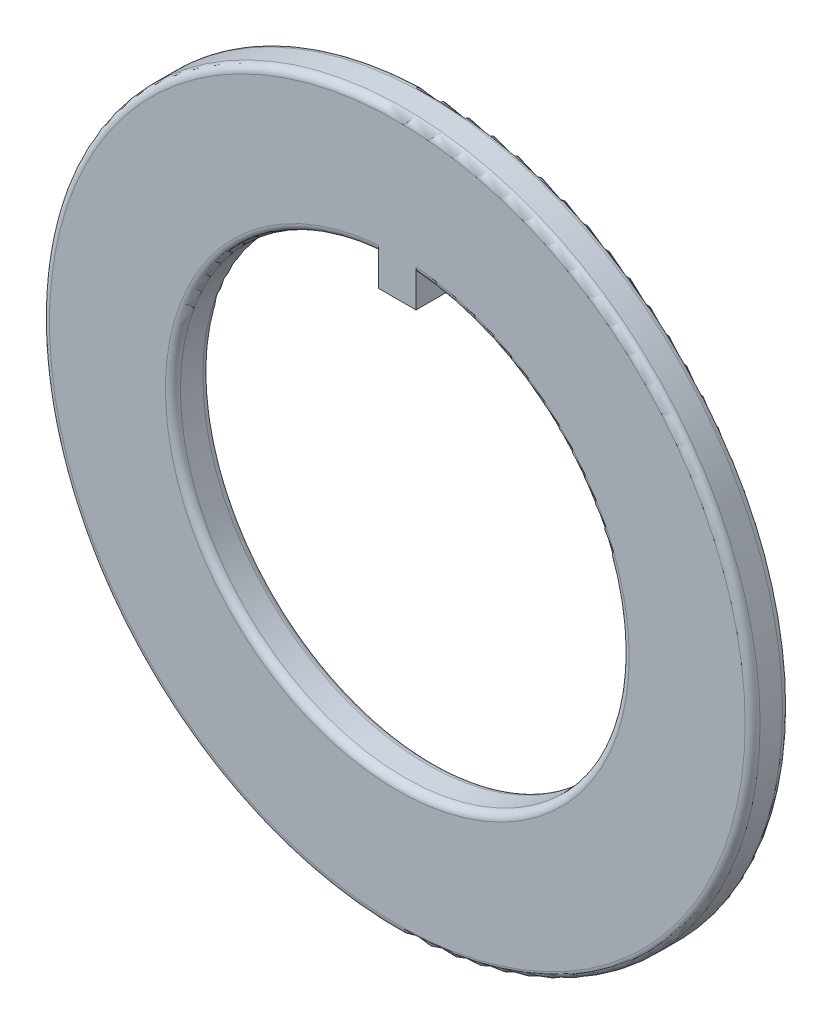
ISO-10303-21;
HEADER;
FILE_DESCRIPTION(('STEP AP214'),'2;1');
FILE_NAME('part.step','',(''),(''),'','','');
FILE_SCHEMA(('AUTOMOTIVE_DESIGN { 1 0 10303 214 1 1 1 1 }'));
ENDSEC;
DATA;
#1=APPLICATION_CONTEXT('core data for automotive mechanical design processes');
#2=APPLICATION_PROTOCOL_DEFINITION('international standard','automotive_design',2000,#1);
#3=PRODUCT_CONTEXT('',#1,'mechanical');
#4=PRODUCT('Part','Part','',(#3));
#5=PRODUCT_RELATED_PRODUCT_CATEGORY('part','',(#4));
#6=PRODUCT_DEFINITION_FORMATION('','',#4);
#7=PRODUCT_DEFINITION_CONTEXT('part definition',#1,'design');
#8=PRODUCT_DEFINITION('design','',#6,#7);
#9=PRODUCT_DEFINITION_SHAPE('','',#8);
#10=(LENGTH_UNIT() NAMED_UNIT(*) SI_UNIT(.MILLI.,.METRE.));
#11=(NAMED_UNIT(*) PLANE_ANGLE_UNIT() SI_UNIT($,.RADIAN.));
#12=(NAMED_UNIT(*) SI_UNIT($,.STERADIAN.) SOLID_ANGLE_UNIT());
#13=UNCERTAINTY_MEASURE_WITH_UNIT(LENGTH_MEASURE(1.E-05),#10,'distance_accuracy_value','');
#14=(GEOMETRIC_REPRESENTATION_CONTEXT(3) GLOBAL_UNCERTAINTY_ASSIGNED_CONTEXT((#13)) GLOBAL_UNIT_ASSIGNED_CONTEXT((#10,
#11,#12)) REPRESENTATION_CONTEXT('',''));
#15=CARTESIAN_POINT('',(0.,0.,0.));
#16=DIRECTION('',(0.,0.,1.));
#17=DIRECTION('',(1.,0.,0.));
#18=AXIS2_PLACEMENT_3D('',#15,#16,#17);
#19=CARTESIAN_POINT('',(0.,0.,1.));
#20=DIRECTION('',(0.,0.,1.));
#21=DIRECTION('',(1.,0.,0.));
#22=AXIS2_PLACEMENT_3D('',#19,#20,#21);
#23=PLANE('',#22);
#24=CARTESIAN_POINT('',(0.,0.,1.));
#25=DIRECTION('',(0.,0.,1.));
#26=DIRECTION('',(1.,0.,0.));
#27=AXIS2_PLACEMENT_3D('',#24,#25,#26);
#28=CIRCLE('',#27,9.3);
#29=CARTESIAN_POINT('',(9.3,0.,1.));
#30=VERTEX_POINT('',#29);
#31=EDGE_CURVE('E135',#30,#30,#28,.T.);
#32=ORIENTED_EDGE('',*,*,#31,.T.);
#33=EDGE_LOOP('',(#32));
#34=FACE_BOUND('',#33,.T.);
#35=DIRECTION('',(0.,-1.,0.));
#36=VECTOR('',#35,1.);
#37=CARTESIAN_POINT('',(0.5,5.1791303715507,1.));
#38=LINE('',#37,#36);
#39=CARTESIAN_POINT('',(0.5,6.17980582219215,1.));
#40=VERTEX_POINT('',#39);
#41=CARTESIAN_POINT('',(0.5,5.1791303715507,1.));
#42=VERTEX_POINT('',#41);
#43=EDGE_CURVE('E52',#40,#42,#38,.T.);
#44=ORIENTED_EDGE('',*,*,#43,.F.);
#45=CARTESIAN_POINT('',(0.,0.,1.));
#46=DIRECTION('',(0.,0.,1.));
#47=DIRECTION('',(1.,0.,0.));
#48=AXIS2_PLACEMENT_3D('',#45,#46,#47);
#49=CIRCLE('',#48,6.2);
#50=CARTESIAN_POINT('',(-0.5,6.17980582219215,1.));
#51=VERTEX_POINT('',#50);
#52=EDGE_CURVE('E138',#40,#51,#49,.F.);
#53=ORIENTED_EDGE('',*,*,#52,.T.);
#54=DIRECTION('',(0.,1.,0.));
#55=VECTOR('',#54,1.);
#56=CARTESIAN_POINT('',(-0.5,5.9791303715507,1.));
#57=LINE('',#56,#55);
#58=CARTESIAN_POINT('',(-0.5,5.1791303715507,1.));
#59=VERTEX_POINT('',#58);
#60=EDGE_CURVE('E59',#59,#51,#57,.T.);
#61=ORIENTED_EDGE('',*,*,#60,.F.);
#62=DIRECTION('',(-1.,0.,0.));
#63=VECTOR('',#62,1.);
#64=CARTESIAN_POINT('',(-0.5,5.1791303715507,1.));
#65=LINE('',#64,#63);
#66=EDGE_CURVE('E93',#42,#59,#65,.T.);
#67=ORIENTED_EDGE('',*,*,#66,.F.);
#68=EDGE_LOOP('',(#44,#53,#61,#67));
#69=FACE_BOUND('',#68,.T.);
#70=ADVANCED_FACE('F33',(#34,#69),#23,.T.);
#71=CARTESIAN_POINT('',(0.,0.,0.));
#72=DIRECTION('',(0.,0.,1.));
#73=DIRECTION('',(1.,0.,0.));
#74=AXIS2_PLACEMENT_3D('',#71,#72,#73);
#75=PLANE('',#74);
#76=CARTESIAN_POINT('',(0.,0.,0.));
#77=DIRECTION('',(0.,0.,1.));
#78=DIRECTION('',(1.,0.,0.));
#79=AXIS2_PLACEMENT_3D('',#76,#77,#78);
#80=CIRCLE('',#79,9.3);
#81=CARTESIAN_POINT('',(9.3,0.,0.));
#82=VERTEX_POINT('',#81);
#83=EDGE_CURVE('E118',#82,#82,#80,.F.);
#84=ORIENTED_EDGE('',*,*,#83,.T.);
#85=EDGE_LOOP('',(#84));
#86=FACE_BOUND('',#85,.T.);
#87=CARTESIAN_POINT('',(0.,0.,0.));
#88=DIRECTION('',(0.,0.,1.));
#89=DIRECTION('',(1.,0.,0.));
#90=AXIS2_PLACEMENT_3D('',#87,#88,#89);
#91=CIRCLE('',#90,6.2);
#92=CARTESIAN_POINT('',(-0.5,6.17980582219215,0.));
#93=VERTEX_POINT('',#92);
#94=CARTESIAN_POINT('',(0.5,6.17980582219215,0.));
#95=VERTEX_POINT('',#94);
#96=EDGE_CURVE('E121',#93,#95,#91,.T.);
#97=ORIENTED_EDGE('',*,*,#96,.T.);
#98=DIRECTION('',(0.,-1.,0.));
#99=VECTOR('',#98,1.);
#100=CARTESIAN_POINT('',(0.5,5.1791303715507,0.));
#101=LINE('',#100,#99);
#102=CARTESIAN_POINT('',(0.5,5.1791303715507,0.));
#103=VERTEX_POINT('',#102);
#104=EDGE_CURVE('E109',#95,#103,#101,.T.);
#105=ORIENTED_EDGE('',*,*,#104,.T.);
#106=DIRECTION('',(-1.,0.,0.));
#107=VECTOR('',#106,1.);
#108=CARTESIAN_POINT('',(-0.5,5.1791303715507,0.));
#109=LINE('',#108,#107);
#110=CARTESIAN_POINT('',(-0.5,5.1791303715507,0.));
#111=VERTEX_POINT('',#110);
#112=EDGE_CURVE('E100',#103,#111,#109,.T.);
#113=ORIENTED_EDGE('',*,*,#112,.T.);
#114=DIRECTION('',(0.,1.,0.));
#115=VECTOR('',#114,1.);
#116=CARTESIAN_POINT('',(-0.5,5.9791303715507,0.));
#117=LINE('',#116,#115);
#118=EDGE_CURVE('E94',#111,#93,#117,.T.);
#119=ORIENTED_EDGE('',*,*,#118,.T.);
#120=EDGE_LOOP('',(#97,#105,#113,#119));
#121=FACE_BOUND('',#120,.T.);
#122=ADVANCED_FACE('F181',(#86,#121),#75,.F.);
#123=CARTESIAN_POINT('',(0.,0.,1.));
#124=DIRECTION('',(0.,0.,-1.));
#125=DIRECTION('',(-1.,0.,0.));
#126=AXIS2_PLACEMENT_3D('',#123,#124,#125);
#127=CYLINDRICAL_SURFACE('',#126,9.5);
#128=CARTESIAN_POINT('',(0.,0.,0.2));
#129=DIRECTION('',(0.,0.,1.));
#130=DIRECTION('',(1.,0.,0.));
#131=AXIS2_PLACEMENT_3D('',#128,#129,#130);
#132=CIRCLE('',#131,9.5);
#133=CARTESIAN_POINT('',(9.5,0.,0.2));
#134=VERTEX_POINT('',#133);
#135=EDGE_CURVE('E132',#134,#134,#132,.T.);
#136=ORIENTED_EDGE('',*,*,#135,.T.);
#137=EDGE_LOOP('',(#136));
#138=FACE_BOUND('',#137,.T.);
#139=CARTESIAN_POINT('',(0.,0.,0.8));
#140=DIRECTION('',(0.,0.,1.));
#141=DIRECTION('',(1.,0.,0.));
#142=AXIS2_PLACEMENT_3D('',#139,#140,#141);
#143=CIRCLE('',#142,9.5);
#144=CARTESIAN_POINT('',(9.5,0.,0.8));
#145=VERTEX_POINT('',#144);
#146=EDGE_CURVE('E129',#145,#145,#143,.F.);
#147=ORIENTED_EDGE('',*,*,#146,.T.);
#148=EDGE_LOOP('',(#147));
#149=FACE_BOUND('',#148,.T.);
#150=ADVANCED_FACE('F186',(#138,#149),#127,.T.);
#151=CARTESIAN_POINT('',(0.,0.,1.));
#152=DIRECTION('',(0.,0.,-1.));
#153=DIRECTION('',(-1.,0.,0.));
#154=AXIS2_PLACEMENT_3D('',#151,#152,#153);
#155=CYLINDRICAL_SURFACE('',#154,6.);
#156=DIRECTION('',(0.,0.,-1.));
#157=VECTOR('',#156,1.);
#158=CARTESIAN_POINT('',(0.5,5.9791303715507,1.));
#159=LINE('',#158,#157);
#160=CARTESIAN_POINT('',(0.5,5.9791303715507,0.8));
#161=VERTEX_POINT('',#160);
#162=CARTESIAN_POINT('',(0.5,5.9791303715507,0.2));
#163=VERTEX_POINT('',#162);
#164=EDGE_CURVE('E102',#161,#163,#159,.T.);
#165=ORIENTED_EDGE('',*,*,#164,.T.);
#166=CARTESIAN_POINT('',(0.,0.,0.2));
#167=DIRECTION('',(0.,0.,1.));
#168=DIRECTION('',(1.,0.,0.));
#169=AXIS2_PLACEMENT_3D('',#166,#167,#168);
#170=CIRCLE('',#169,6.);
#171=CARTESIAN_POINT('',(-0.5,5.9791303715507,0.2));
#172=VERTEX_POINT('',#171);
#173=EDGE_CURVE('E127',#163,#172,#170,.F.);
#174=ORIENTED_EDGE('',*,*,#173,.T.);
#175=DIRECTION('',(0.,0.,-1.));
#176=VECTOR('',#175,1.);
#177=CARTESIAN_POINT('',(-0.5,5.9791303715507,1.));
#178=LINE('',#177,#176);
#179=CARTESIAN_POINT('',(-0.5,5.9791303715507,0.8));
#180=VERTEX_POINT('',#179);
#181=EDGE_CURVE('E106',#180,#172,#178,.T.);
#182=ORIENTED_EDGE('',*,*,#181,.F.);
#183=CARTESIAN_POINT('',(0.,0.,0.8));
#184=DIRECTION('',(0.,0.,1.));
#185=DIRECTION('',(1.,0.,0.));
#186=AXIS2_PLACEMENT_3D('',#183,#184,#185);
#187=CIRCLE('',#186,6.);
#188=EDGE_CURVE('E124',#180,#161,#187,.T.);
#189=ORIENTED_EDGE('',*,*,#188,.T.);
#190=EDGE_LOOP('',(#165,#174,#182,#189));
#191=FACE_BOUND('',#190,.T.);
#192=ADVANCED_FACE('F159',(#191),#155,.F.);
#193=CARTESIAN_POINT('',(0.5,5.1791303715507,1.));
#194=DIRECTION('',(1.,0.,0.));
#195=DIRECTION('',(0.,0.,-1.));
#196=AXIS2_PLACEMENT_3D('',#193,#194,#195);
#197=PLANE('',#196);
#198=ORIENTED_EDGE('',*,*,#104,.F.);
#199=CARTESIAN_POINT('',(0.5,6.17980582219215,0.));
#200=CARTESIAN_POINT('',(0.5,6.16848900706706,-9.42369699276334E-06));
#201=CARTESIAN_POINT('',(0.5,6.15717486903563,0.000953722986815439));
#202=CARTESIAN_POINT('',(0.5,6.13487391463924,0.00475563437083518));
#203=CARTESIAN_POINT('',(0.5,6.12388687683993,0.00759309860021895));
#204=CARTESIAN_POINT('',(0.5,6.10254011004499,0.0150761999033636));
#205=CARTESIAN_POINT('',(0.5,6.09218070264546,0.0197227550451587));
#206=CARTESIAN_POINT('',(0.5,6.07239231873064,0.0306899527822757));
#207=CARTESIAN_POINT('',(0.5,6.062963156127,0.037010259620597));
#208=CARTESIAN_POINT('',(0.5,6.04531581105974,0.0511385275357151));
#209=CARTESIAN_POINT('',(0.5,6.0370959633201,0.0589444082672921));
#210=CARTESIAN_POINT('',(0.5,6.02208679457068,0.0758311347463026));
#211=CARTESIAN_POINT('',(0.5,6.01529774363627,0.0849122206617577));
#212=CARTESIAN_POINT('',(0.5,6.00336713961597,0.104060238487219));
#213=CARTESIAN_POINT('',(0.5,5.99822075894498,0.11412416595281));
#214=CARTESIAN_POINT('',(0.5,5.98969950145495,0.134972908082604));
#215=CARTESIAN_POINT('',(0.5,5.98632349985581,0.145757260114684));
#216=CARTESIAN_POINT('',(0.5,5.98230220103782,0.163842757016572));
#217=CARTESIAN_POINT('',(0.5,5.98111348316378,0.171027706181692));
#218=CARTESIAN_POINT('',(0.5,5.97952769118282,0.185474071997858));
#219=CARTESIAN_POINT('',(0.5,5.97912949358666,0.192735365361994));
#220=CARTESIAN_POINT('',(0.5,5.97913037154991,0.199999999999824));
#221=B_SPLINE_CURVE_WITH_KNOTS('',3,(#199,#200,#201,#202,#203,#204,#205,#206,#207,#208,#209,
#210,#211,#212,#213,#214,#215,#216,#217,#218,#219,#220),.UNSPECIFIED.,.F.,.F.,(4,2,2,2,2,2,2,2,
2,2,4),(0.,0.0339057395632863,0.0677879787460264,0.101687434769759,0.135580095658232,
0.169425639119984,0.203277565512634,0.237029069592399,0.270759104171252,0.292566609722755,
0.314343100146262),.UNSPECIFIED.);
#222=EDGE_CURVE('E140',#95,#163,#221,.T.);
#223=ORIENTED_EDGE('',*,*,#222,.T.);
#224=ORIENTED_EDGE('',*,*,#164,.F.);
#225=CARTESIAN_POINT('',(0.5,5.9791303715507,0.8));
#226=CARTESIAN_POINT('',(0.5,5.97912064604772,0.811223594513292));
#227=CARTESIAN_POINT('',(0.5,5.9800778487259,0.82244409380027));
#228=CARTESIAN_POINT('',(0.5,5.983854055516,0.844557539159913));
#229=CARTESIAN_POINT('',(0.5,5.98667140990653,0.855450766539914));
#230=CARTESIAN_POINT('',(0.5,5.99409775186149,0.876614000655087));
#231=CARTESIAN_POINT('',(0.5,5.99870753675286,0.886883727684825));
#232=CARTESIAN_POINT('',(0.5,6.0095818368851,0.906503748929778));
#233=CARTESIAN_POINT('',(0.5,6.01584610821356,0.915854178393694));
#234=CARTESIAN_POINT('',(0.5,6.02986187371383,0.933388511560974));
#235=CARTESIAN_POINT('',(0.5,6.03761566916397,0.941570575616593));
#236=CARTESIAN_POINT('',(0.5,6.05438456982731,0.95652360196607));
#237=CARTESIAN_POINT('',(0.5,6.06339993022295,0.963294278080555));
#238=CARTESIAN_POINT('',(0.5,6.08246698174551,0.975254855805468));
#239=CARTESIAN_POINT('',(0.5,6.09252214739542,0.980439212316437));
#240=CARTESIAN_POINT('',(0.5,6.11335653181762,0.989049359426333));
#241=CARTESIAN_POINT('',(0.5,6.1241353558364,0.992476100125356));
#242=CARTESIAN_POINT('',(0.5,6.14244794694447,0.996646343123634));
#243=CARTESIAN_POINT('',(0.5,6.14986893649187,0.997903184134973));
#244=CARTESIAN_POINT('',(0.5,6.16479421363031,0.999579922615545));
#245=CARTESIAN_POINT('',(0.5,6.17229836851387,1.00000100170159));
#246=CARTESIAN_POINT('',(0.5,6.1798058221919,1.00000000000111));
#247=B_SPLINE_CURVE_WITH_KNOTS('',3,(#225,#226,#227,#228,#229,#230,#231,#232,#233,#234,#235,
#236,#237,#238,#239,#240,#241,#242,#243,#244,#245,#246),.UNSPECIFIED.,.F.,.F.,(4,2,2,2,2,2,2,2,
2,2,4),(0.,0.0336255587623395,0.0672213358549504,0.100832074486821,0.134437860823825,
0.168095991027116,0.201760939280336,0.23554225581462,0.269305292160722,0.291841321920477,
0.314345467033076),.UNSPECIFIED.);
#248=EDGE_CURVE('E45',#161,#40,#247,.T.);
#249=ORIENTED_EDGE('',*,*,#248,.T.);
#250=ORIENTED_EDGE('',*,*,#43,.T.);
#251=DIRECTION('',(0.,0.,-1.));
#252=VECTOR('',#251,1.);
#253=CARTESIAN_POINT('',(0.5,5.1791303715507,1.));
#254=LINE('',#253,#252);
#255=EDGE_CURVE('E89',#42,#103,#254,.T.);
#256=ORIENTED_EDGE('',*,*,#255,.T.);
#257=EDGE_LOOP('',(#198,#223,#224,#249,#250,#256));
#258=FACE_BOUND('',#257,.T.);
#259=ADVANCED_FACE('F88',(#258),#197,.T.);
#260=CARTESIAN_POINT('',(-0.5,5.1791303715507,1.));
#261=DIRECTION('',(0.,-1.,0.));
#262=DIRECTION('',(0.,0.,-1.));
#263=AXIS2_PLACEMENT_3D('',#260,#261,#262);
#264=PLANE('',#263);
#265=ORIENTED_EDGE('',*,*,#112,.F.);
#266=ORIENTED_EDGE('',*,*,#255,.F.);
#267=ORIENTED_EDGE('',*,*,#66,.T.);
#268=DIRECTION('',(0.,0.,-1.));
#269=VECTOR('',#268,1.);
#270=CARTESIAN_POINT('',(-0.5,5.1791303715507,1.));
#271=LINE('',#270,#269);
#272=EDGE_CURVE('E103',#59,#111,#271,.T.);
#273=ORIENTED_EDGE('',*,*,#272,.T.);
#274=EDGE_LOOP('',(#265,#266,#267,#273));
#275=FACE_BOUND('',#274,.T.);
#276=ADVANCED_FACE('F98',(#275),#264,.T.);
#277=CARTESIAN_POINT('',(-0.5,5.9791303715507,1.));
#278=DIRECTION('',(-1.,0.,0.));
#279=DIRECTION('',(0.,-1.,0.));
#280=AXIS2_PLACEMENT_3D('',#277,#278,#279);
#281=PLANE('',#280);
#282=ORIENTED_EDGE('',*,*,#118,.F.);
#283=ORIENTED_EDGE('',*,*,#272,.F.);
#284=ORIENTED_EDGE('',*,*,#60,.T.);
#285=CARTESIAN_POINT('',(-0.5,6.17980582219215,1.));
#286=CARTESIAN_POINT('',(-0.5,6.16848900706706,1.00000942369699));
#287=CARTESIAN_POINT('',(-0.5,6.15717486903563,0.999046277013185));
#288=CARTESIAN_POINT('',(-0.5,6.13487391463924,0.995244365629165));
#289=CARTESIAN_POINT('',(-0.5,6.12388687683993,0.992406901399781));
#290=CARTESIAN_POINT('',(-0.5,6.10254011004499,0.984923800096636));
#291=CARTESIAN_POINT('',(-0.5,6.09218070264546,0.980277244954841));
#292=CARTESIAN_POINT('',(-0.5,6.07239231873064,0.969310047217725));
#293=CARTESIAN_POINT('',(-0.5,6.062963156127,0.962989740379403));
#294=CARTESIAN_POINT('',(-0.5,6.04531581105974,0.948861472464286));
#295=CARTESIAN_POINT('',(-0.5,6.0370959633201,0.941055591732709));
#296=CARTESIAN_POINT('',(-0.5,6.02208679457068,0.924168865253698));
#297=CARTESIAN_POINT('',(-0.5,6.01529774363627,0.915087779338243));
#298=CARTESIAN_POINT('',(-0.5,6.00336713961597,0.895939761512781));
#299=CARTESIAN_POINT('',(-0.5,5.99822075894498,0.88587583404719));
#300=CARTESIAN_POINT('',(-0.5,5.98969950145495,0.865027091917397));
#301=CARTESIAN_POINT('',(-0.5,5.98632349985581,0.854242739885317));
#302=CARTESIAN_POINT('',(-0.5,5.98230220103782,0.836157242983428));
#303=CARTESIAN_POINT('',(-0.5,5.98111348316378,0.828972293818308));
#304=CARTESIAN_POINT('',(-0.5,5.97952769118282,0.814525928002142));
#305=CARTESIAN_POINT('',(-0.5,5.97912949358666,0.807264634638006));
#306=CARTESIAN_POINT('',(-0.5,5.97913037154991,0.800000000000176));
#307=B_SPLINE_CURVE_WITH_KNOTS('',3,(#285,#286,#287,#288,#289,#290,#291,#292,#293,#294,#295,
#296,#297,#298,#299,#300,#301,#302,#303,#304,#305,#306),.UNSPECIFIED.,.F.,.F.,(4,2,2,2,2,2,2,2,
2,2,4),(0.,0.0339057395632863,0.0677879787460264,0.101687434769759,0.135580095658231,
0.169425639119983,0.203277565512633,0.237029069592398,0.270759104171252,0.292566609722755,
0.314343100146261),.UNSPECIFIED.);
#308=EDGE_CURVE('E11',#51,#180,#307,.T.);
#309=ORIENTED_EDGE('',*,*,#308,.T.);
#310=ORIENTED_EDGE('',*,*,#181,.T.);
#311=CARTESIAN_POINT('',(-0.5,5.9791303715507,0.2));
#312=CARTESIAN_POINT('',(-0.5,5.97912064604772,0.188776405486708));
#313=CARTESIAN_POINT('',(-0.5,5.9800778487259,0.17755590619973));
#314=CARTESIAN_POINT('',(-0.5,5.983854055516,0.155442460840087));
#315=CARTESIAN_POINT('',(-0.5,5.98667140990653,0.144549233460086));
#316=CARTESIAN_POINT('',(-0.5,5.99409775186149,0.123385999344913));
#317=CARTESIAN_POINT('',(-0.5,5.99870753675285,0.113116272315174));
#318=CARTESIAN_POINT('',(-0.5,6.00958183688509,0.0934962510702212));
#319=CARTESIAN_POINT('',(-0.5,6.01584610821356,0.0841458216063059));
#320=CARTESIAN_POINT('',(-0.5,6.02986187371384,0.0666114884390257));
#321=CARTESIAN_POINT('',(-0.5,6.03761566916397,0.0584294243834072));
#322=CARTESIAN_POINT('',(-0.5,6.05438456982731,0.0434763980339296));
#323=CARTESIAN_POINT('',(-0.5,6.06339993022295,0.0367057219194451));
#324=CARTESIAN_POINT('',(-0.5,6.08246698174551,0.0247451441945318));
#325=CARTESIAN_POINT('',(-0.5,6.09252214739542,0.0195607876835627));
#326=CARTESIAN_POINT('',(-0.5,6.11335653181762,0.0109506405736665));
#327=CARTESIAN_POINT('',(-0.5,6.1241353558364,0.00752389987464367));
#328=CARTESIAN_POINT('',(-0.5,6.14244794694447,0.0033536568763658));
#329=CARTESIAN_POINT('',(-0.5,6.14986893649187,0.00209681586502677));
#330=CARTESIAN_POINT('',(-0.5,6.16479421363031,0.000420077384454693));
#331=CARTESIAN_POINT('',(-0.5,6.17229836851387,-1.00170159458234E-06));
#332=CARTESIAN_POINT('',(-0.5,6.1798058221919,-1.11282111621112E-12));
#333=B_SPLINE_CURVE_WITH_KNOTS('',3,(#311,#312,#313,#314,#315,#316,#317,#318,#319,#320,#321,
#322,#323,#324,#325,#326,#327,#328,#329,#330,#331,#332),.UNSPECIFIED.,.F.,.F.,(4,2,2,2,2,2,2,2,
2,2,4),(0.,0.0336255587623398,0.0672213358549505,0.100832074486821,0.134437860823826,
0.168095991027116,0.201760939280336,0.23554225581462,0.269305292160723,0.291841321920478,
0.314345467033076),.UNSPECIFIED.);
#334=EDGE_CURVE('E147',#172,#93,#333,.T.);
#335=ORIENTED_EDGE('',*,*,#334,.T.);
#336=EDGE_LOOP('',(#282,#283,#284,#309,#310,#335));
#337=FACE_BOUND('',#336,.T.);
#338=ADVANCED_FACE('F176',(#337),#281,.T.);
#339=CARTESIAN_POINT('',(0.,0.,0.2));
#340=DIRECTION('',(0.,0.,1.));
#341=DIRECTION('',(1.,0.,0.));
#342=AXIS2_PLACEMENT_3D('',#339,#340,#341);
#343=TOROIDAL_SURFACE('',#342,6.2,0.2);
#344=ORIENTED_EDGE('',*,*,#334,.F.);
#345=ORIENTED_EDGE('',*,*,#173,.F.);
#346=ORIENTED_EDGE('',*,*,#222,.F.);
#347=ORIENTED_EDGE('',*,*,#96,.F.);
#348=EDGE_LOOP('',(#344,#345,#346,#347));
#349=FACE_BOUND('',#348,.T.);
#350=ADVANCED_FACE('F151',(#349),#343,.T.);
#351=CARTESIAN_POINT('',(0.,0.,0.2));
#352=DIRECTION('',(0.,0.,1.));
#353=DIRECTION('',(1.,0.,0.));
#354=AXIS2_PLACEMENT_3D('',#351,#352,#353);
#355=TOROIDAL_SURFACE('',#354,9.3,0.2);
#356=ORIENTED_EDGE('',*,*,#83,.F.);
#357=EDGE_LOOP('',(#356));
#358=FACE_BOUND('',#357,.T.);
#359=ORIENTED_EDGE('',*,*,#135,.F.);
#360=EDGE_LOOP('',(#359));
#361=FACE_BOUND('',#360,.T.);
#362=ADVANCED_FACE('F168',(#358,#361),#355,.T.);
#363=CARTESIAN_POINT('',(0.,0.,0.8));
#364=DIRECTION('',(0.,0.,1.));
#365=DIRECTION('',(1.,0.,0.));
#366=AXIS2_PLACEMENT_3D('',#363,#364,#365);
#367=TOROIDAL_SURFACE('',#366,6.2,0.2);
#368=ORIENTED_EDGE('',*,*,#308,.F.);
#369=ORIENTED_EDGE('',*,*,#52,.F.);
#370=ORIENTED_EDGE('',*,*,#248,.F.);
#371=ORIENTED_EDGE('',*,*,#188,.F.);
#372=EDGE_LOOP('',(#368,#369,#370,#371));
#373=FACE_BOUND('',#372,.T.);
#374=ADVANCED_FACE('F165',(#373),#367,.T.);
#375=CARTESIAN_POINT('',(0.,0.,0.8));
#376=DIRECTION('',(0.,0.,1.));
#377=DIRECTION('',(1.,0.,0.));
#378=AXIS2_PLACEMENT_3D('',#375,#376,#377);
#379=TOROIDAL_SURFACE('',#378,9.3,0.2);
#380=ORIENTED_EDGE('',*,*,#146,.F.);
#381=EDGE_LOOP('',(#380));
#382=FACE_BOUND('',#381,.T.);
#383=ORIENTED_EDGE('',*,*,#31,.F.);
#384=EDGE_LOOP('',(#383));
#385=FACE_BOUND('',#384,.T.);
#386=ADVANCED_FACE('F35',(#382,#385),#379,.T.);
#387=CLOSED_SHELL('',(#70,#122,#150,#192,#259,#276,#338,#350,#362,#374,#386));
#388=MANIFOLD_SOLID_BREP('B2',#387);
#389=ADVANCED_BREP_SHAPE_REPRESENTATION('',(#18,#388),#14);
#390=SHAPE_DEFINITION_REPRESENTATION(#9,#389);
ENDSEC;
END-ISO-10303-21;
